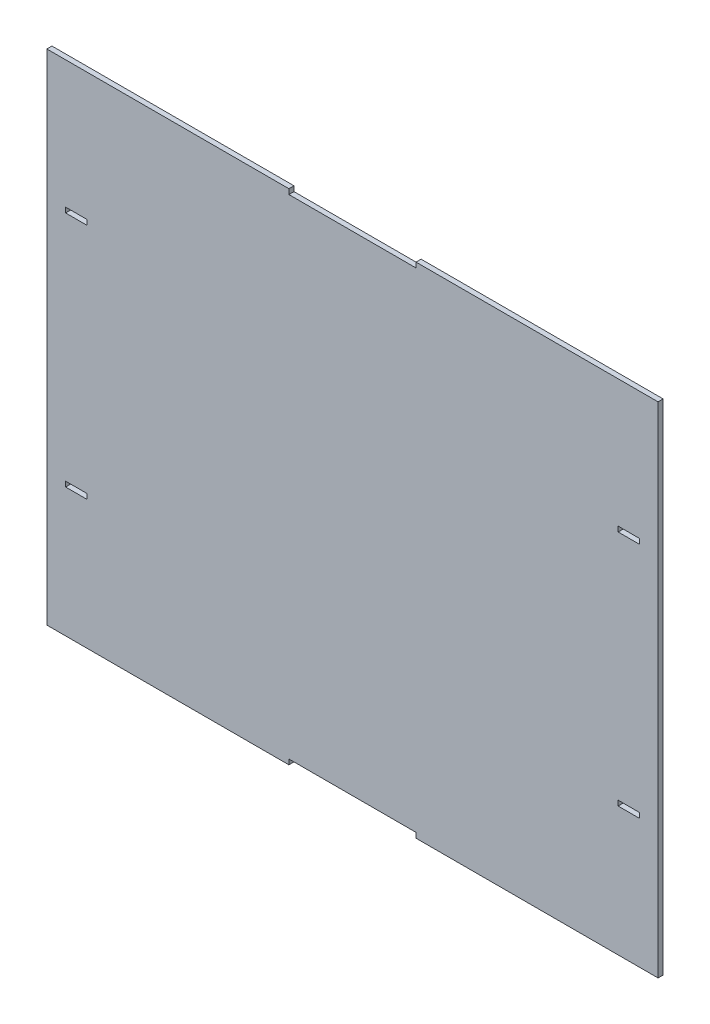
from build123d import *

# Parameters (mm, degrees)
SKETCH1_W           = 6.35
SKETCH1_H           = 1.524
BOSS_EXTRUDE1_DEPTH = 1.524


with BuildPart() as part:
    # Sketch1 → Boss-Extrude1 (new body)
    with BuildSketch(Plane.XY):
        Polygon((208.026, -149.62337859), (135.431414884, -149.62337859), (135.431414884, 0), (208.026, 0), (208.026, -1.524), (246.126, -1.524), (246.126, 0), (318.720585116, 0), (318.720585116, -149.62337859), (246.126, -149.62337859), (246.126, -148.09937859), (208.026, -148.09937859), align=None)
        with Locations((144.233510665, -110.191560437)):
            Rectangle(SKETCH1_W, SKETCH1_H, mode=Mode.SUBTRACT)
        with Locations((144.233510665, -39.021953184)):
            Rectangle(SKETCH1_W, SKETCH1_H, mode=Mode.SUBTRACT)
        with Locations((309.918489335, -39.021953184)):
            Rectangle(SKETCH1_W, SKETCH1_H, mode=Mode.SUBTRACT)
        with Locations((309.918489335, -110.191560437)):
            Rectangle(SKETCH1_W, SKETCH1_H, mode=Mode.SUBTRACT)
    extrude(amount=BOSS_EXTRUDE1_DEPTH)


solid = part.part
